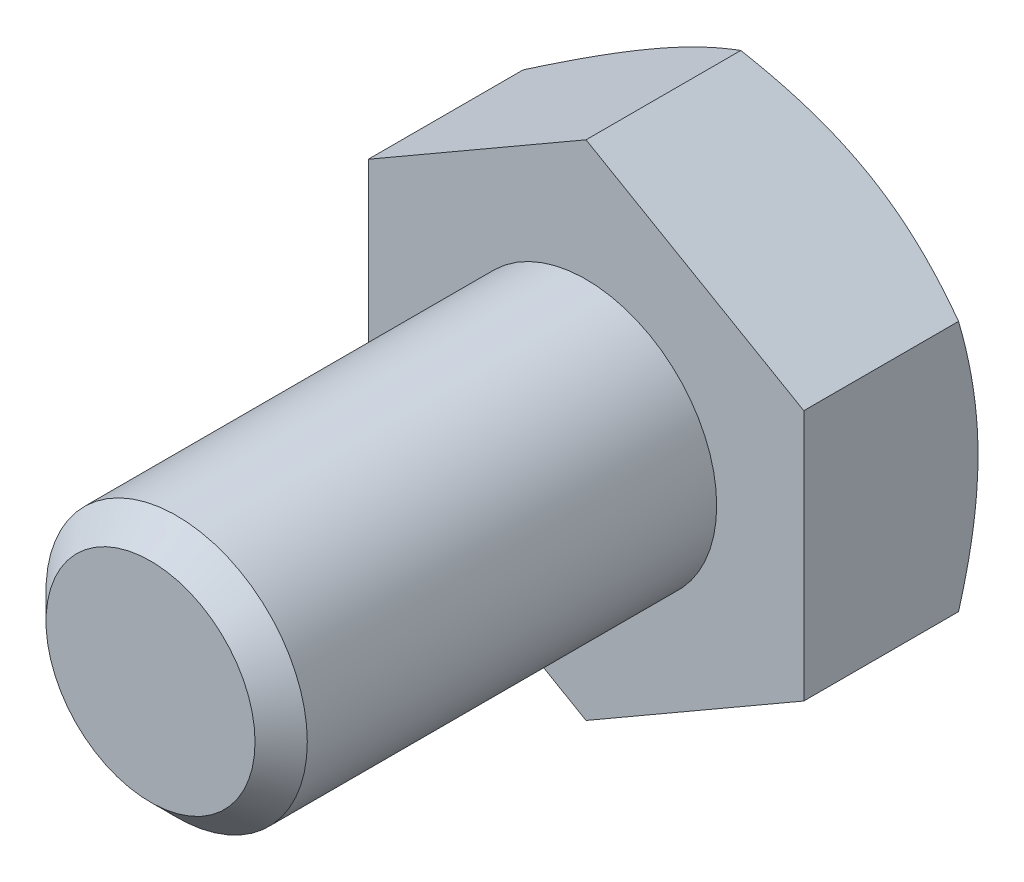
ISO-10303-21;
HEADER;
FILE_DESCRIPTION(('STEP AP214'),'2;1');
FILE_NAME('part.step','',(''),(''),'','','');
FILE_SCHEMA(('AUTOMOTIVE_DESIGN { 1 0 10303 214 1 1 1 1 }'));
ENDSEC;
DATA;
#1=APPLICATION_CONTEXT('core data for automotive mechanical design processes');
#2=APPLICATION_PROTOCOL_DEFINITION('international standard','automotive_design',2000,#1);
#3=PRODUCT_CONTEXT('',#1,'mechanical');
#4=PRODUCT('Part','Part','',(#3));
#5=PRODUCT_RELATED_PRODUCT_CATEGORY('part','',(#4));
#6=PRODUCT_DEFINITION_FORMATION('','',#4);
#7=PRODUCT_DEFINITION_CONTEXT('part definition',#1,'design');
#8=PRODUCT_DEFINITION('design','',#6,#7);
#9=PRODUCT_DEFINITION_SHAPE('','',#8);
#10=(LENGTH_UNIT() NAMED_UNIT(*) SI_UNIT(.MILLI.,.METRE.));
#11=(NAMED_UNIT(*) PLANE_ANGLE_UNIT() SI_UNIT($,.RADIAN.));
#12=(NAMED_UNIT(*) SI_UNIT($,.STERADIAN.) SOLID_ANGLE_UNIT());
#13=UNCERTAINTY_MEASURE_WITH_UNIT(LENGTH_MEASURE(1.E-05),#10,'distance_accuracy_value','');
#14=(GEOMETRIC_REPRESENTATION_CONTEXT(3) GLOBAL_UNCERTAINTY_ASSIGNED_CONTEXT((#13)) GLOBAL_UNIT_ASSIGNED_CONTEXT((#10,
#11,#12)) REPRESENTATION_CONTEXT('',''));
#15=CARTESIAN_POINT('',(0.,0.,0.));
#16=DIRECTION('',(0.,0.,1.));
#17=DIRECTION('',(1.,0.,0.));
#18=AXIS2_PLACEMENT_3D('',#15,#16,#17);
#19=CARTESIAN_POINT('',(0.,0.,10.));
#20=DIRECTION('',(0.,0.,1.));
#21=DIRECTION('',(1.,0.,0.));
#22=AXIS2_PLACEMENT_3D('',#19,#20,#21);
#23=PLANE('',#22);
#24=CARTESIAN_POINT('',(0.,0.,10.));
#25=DIRECTION('',(0.,0.,1.));
#26=DIRECTION('',(1.,0.,0.));
#27=AXIS2_PLACEMENT_3D('',#24,#25,#26);
#28=CIRCLE('',#27,2.4);
#29=CARTESIAN_POINT('',(2.4,0.,10.));
#30=VERTEX_POINT('',#29);
#31=EDGE_CURVE('E203',#30,#30,#28,.T.);
#32=ORIENTED_EDGE('',*,*,#31,.T.);
#33=EDGE_LOOP('',(#32));
#34=FACE_BOUND('',#33,.T.);
#35=ADVANCED_FACE('F29',(#34),#23,.T.);
#36=CARTESIAN_POINT('',(0.,0.,0.));
#37=DIRECTION('',(0.,0.,1.));
#38=DIRECTION('',(1.,0.,0.));
#39=AXIS2_PLACEMENT_3D('',#36,#37,#38);
#40=CYLINDRICAL_SURFACE('',#39,3.);
#41=CARTESIAN_POINT('',(0.,0.,9.4));
#42=DIRECTION('',(0.,0.,1.));
#43=DIRECTION('',(1.,0.,0.));
#44=AXIS2_PLACEMENT_3D('',#41,#42,#43);
#45=CIRCLE('',#44,3.);
#46=CARTESIAN_POINT('',(3.,0.,9.4));
#47=VERTEX_POINT('',#46);
#48=EDGE_CURVE('E205',#47,#47,#45,.F.);
#49=ORIENTED_EDGE('',*,*,#48,.T.);
#50=EDGE_LOOP('',(#49));
#51=FACE_BOUND('',#50,.T.);
#52=CARTESIAN_POINT('',(0.,0.,0.));
#53=DIRECTION('',(0.,0.,1.));
#54=DIRECTION('',(1.,0.,0.));
#55=AXIS2_PLACEMENT_3D('',#52,#53,#54);
#56=CIRCLE('',#55,3.);
#57=CARTESIAN_POINT('',(3.,0.,0.));
#58=VERTEX_POINT('',#57);
#59=EDGE_CURVE('E206',#58,#58,#56,.F.);
#60=ORIENTED_EDGE('',*,*,#59,.F.);
#61=EDGE_LOOP('',(#60));
#62=FACE_BOUND('',#61,.T.);
#63=ADVANCED_FACE('F194',(#51,#62),#40,.T.);
#64=CARTESIAN_POINT('',(0.,0.,10.));
#65=DIRECTION('',(0.,0.,-1.));
#66=DIRECTION('',(-1.,0.,0.));
#67=AXIS2_PLACEMENT_3D('',#64,#65,#66);
#68=CONICAL_SURFACE('',#67,2.4,0.785398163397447);
#69=ORIENTED_EDGE('',*,*,#48,.F.);
#70=EDGE_LOOP('',(#69));
#71=FACE_BOUND('',#70,.T.);
#72=ORIENTED_EDGE('',*,*,#31,.F.);
#73=EDGE_LOOP('',(#72));
#74=FACE_BOUND('',#73,.T.);
#75=ADVANCED_FACE('F199',(#71,#74),#68,.T.);
#76=CARTESIAN_POINT('',(0.,5.77350269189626,-4.));
#77=DIRECTION('',(0.499999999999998,0.86602540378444,0.));
#78=DIRECTION('',(-0.86602540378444,0.499999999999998,0.));
#79=AXIS2_PLACEMENT_3D('',#76,#77,#78);
#80=PLANE('',#79);
#81=CARTESIAN_POINT('',(-0.000200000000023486,5.7736181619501,-3.55335134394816));
#82=CARTESIAN_POINT('',(0.219534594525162,5.64675433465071,-3.62661343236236));
#83=CARTESIAN_POINT('',(0.441148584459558,5.5188054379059,-3.6932486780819));
#84=CARTESIAN_POINT('',(0.888213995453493,5.26069210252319,-3.80956100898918));
#85=CARTESIAN_POINT('',(1.11367335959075,5.13052307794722,-3.85919695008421));
#86=CARTESIAN_POINT('',(1.56183230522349,4.87177839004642,-3.9364489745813));
#87=CARTESIAN_POINT('',(1.78446209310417,4.74324302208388,-3.96457962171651));
#88=CARTESIAN_POINT('',(2.11918990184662,4.54998783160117,-3.98980507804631));
#89=CARTESIAN_POINT('',(2.23084219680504,4.48552534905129,-3.99538654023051));
#90=CARTESIAN_POINT('',(2.45424997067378,4.35654081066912,-4.00079778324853));
#91=CARTESIAN_POINT('',(2.5660054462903,4.29201875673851,-4.00062774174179));
#92=CARTESIAN_POINT('',(2.87218423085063,4.11524635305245,-3.99224636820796));
#93=CARTESIAN_POINT('',(3.0665060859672,4.00305457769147,-3.97817022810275));
#94=CARTESIAN_POINT('',(3.45386010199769,3.77941563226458,-3.93353474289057));
#95=CARTESIAN_POINT('',(3.64689090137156,3.66796924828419,-3.90296013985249));
#96=CARTESIAN_POINT('',(4.03502534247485,3.44387972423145,-3.82653150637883));
#97=CARTESIAN_POINT('',(4.23007999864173,3.33126486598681,-3.78035362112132));
#98=CARTESIAN_POINT('',(4.61728034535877,3.10771464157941,-3.67554820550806));
#99=CARTESIAN_POINT('',(4.80943099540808,2.99677641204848,-3.61694529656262));
#100=CARTESIAN_POINT('',(5.0002,2.8866358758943,-3.55335134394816));
#101=B_SPLINE_CURVE_WITH_KNOTS('',3,(#81,#82,#83,#84,#85,#86,#87,#88,#89,#90,#91,#92,#93,#94,
#95,#96,#97,#98,#99,#100),.UNSPECIFIED.,.F.,.F.,(4,2,2,2,2,2,2,2,2,4),(0.,0.792555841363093,
1.58701660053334,2.36181537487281,2.74884076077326,3.13585419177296,3.8096236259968,
4.4840172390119,5.1733688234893,5.86136694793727),.UNSPECIFIED.);
#102=CARTESIAN_POINT('',(0.,5.77350269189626,-3.55341801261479));
#103=VERTEX_POINT('',#102);
#104=CARTESIAN_POINT('',(2.49999999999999,4.3301270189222,-4.));
#105=VERTEX_POINT('',#104);
#106=EDGE_CURVE('E239',#103,#105,#101,.T.);
#107=ORIENTED_EDGE('',*,*,#106,.F.);
#108=DIRECTION('',(0.,0.,1.));
#109=VECTOR('',#108,1.);
#110=CARTESIAN_POINT('',(0.,5.77350269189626,-4.));
#111=LINE('',#110,#109);
#112=CARTESIAN_POINT('',(0.,5.77350269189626,0.));
#113=VERTEX_POINT('',#112);
#114=EDGE_CURVE('E213',#103,#113,#111,.T.);
#115=ORIENTED_EDGE('',*,*,#114,.T.);
#116=DIRECTION('',(-0.86602540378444,0.499999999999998,0.));
#117=VECTOR('',#116,1.);
#118=CARTESIAN_POINT('',(0.,5.77350269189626,0.));
#119=LINE('',#118,#117);
#120=CARTESIAN_POINT('',(5.,2.88675134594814,0.));
#121=VERTEX_POINT('',#120);
#122=EDGE_CURVE('E237',#121,#113,#119,.T.);
#123=ORIENTED_EDGE('',*,*,#122,.F.);
#124=DIRECTION('',(0.,0.,1.));
#125=VECTOR('',#124,1.);
#126=CARTESIAN_POINT('',(5.,2.88675134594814,-4.));
#127=LINE('',#126,#125);
#128=CARTESIAN_POINT('',(5.,2.88675134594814,-3.55341801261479));
#129=VERTEX_POINT('',#128);
#130=EDGE_CURVE('E210',#129,#121,#127,.T.);
#131=ORIENTED_EDGE('',*,*,#130,.F.);
#132=EDGE_CURVE('E169',#105,#129,#101,.T.);
#133=ORIENTED_EDGE('',*,*,#132,.F.);
#134=EDGE_LOOP('',(#107,#115,#123,#131,#133));
#135=FACE_BOUND('',#134,.T.);
#136=ADVANCED_FACE('F179',(#135),#80,.T.);
#137=CARTESIAN_POINT('',(5.,-2.88675134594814,-4.));
#138=DIRECTION('',(1.,0.,0.));
#139=DIRECTION('',(0.,0.,-1.));
#140=AXIS2_PLACEMENT_3D('',#137,#138,#139);
#141=PLANE('',#140);
#142=CARTESIAN_POINT('',(5.,-7.87365701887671,-1.5017575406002));
#143=CARTESIAN_POINT('',(5.,-7.65421637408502,-1.60868091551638));
#144=CARTESIAN_POINT('',(5.,-7.43428458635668,-1.71461296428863));
#145=CARTESIAN_POINT('',(5.,-6.99317792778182,-1.92393906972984));
#146=CARTESIAN_POINT('',(5.,-6.77200287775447,-2.02733274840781));
#147=CARTESIAN_POINT('',(5.,-6.32706593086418,-2.23152152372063));
#148=CARTESIAN_POINT('',(5.,-6.10329657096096,-2.3323004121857));
#149=CARTESIAN_POINT('',(5.,-5.65401907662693,-2.52988978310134));
#150=CARTESIAN_POINT('',(5.,-5.42851102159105,-2.62670044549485));
#151=CARTESIAN_POINT('',(5.,-4.96773019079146,-2.81850105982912));
#152=CARTESIAN_POINT('',(5.,-4.73238523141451,-2.91331851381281));
#153=CARTESIAN_POINT('',(5.,-4.2589865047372,-3.09606229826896));
#154=CARTESIAN_POINT('',(5.,-4.02093244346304,-3.18398787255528));
#155=CARTESIAN_POINT('',(5.,-3.54214478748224,-3.35072723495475));
#156=CARTESIAN_POINT('',(5.,-3.301417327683,-3.42955846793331));
#157=CARTESIAN_POINT('',(5.,-2.81651125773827,-3.57565910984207));
#158=CARTESIAN_POINT('',(5.,-2.57233372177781,-3.64293203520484));
#159=CARTESIAN_POINT('',(5.,-2.08173956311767,-3.7624103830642));
#160=CARTESIAN_POINT('',(5.,-1.83534384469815,-3.81470009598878));
#161=CARTESIAN_POINT('',(5.,-1.33936717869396,-3.90133365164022));
#162=CARTESIAN_POINT('',(5.,-1.08978658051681,-3.93567944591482));
#163=CARTESIAN_POINT('',(5.,-0.591994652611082,-3.98324171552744));
#164=CARTESIAN_POINT('',(5.,-0.34381084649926,-3.99673913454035));
#165=CARTESIAN_POINT('',(5.,0.152820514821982,-4.00220795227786));
#166=CARTESIAN_POINT('',(5.,0.401268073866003,-3.99417903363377));
#167=CARTESIAN_POINT('',(5.,0.819539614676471,-3.96311999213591));
#168=CARTESIAN_POINT('',(5.,0.989794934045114,-3.94552930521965));
#169=CARTESIAN_POINT('',(5.,1.32912938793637,-3.90127081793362));
#170=CARTESIAN_POINT('',(5.,1.49820837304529,-3.87460188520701));
#171=CARTESIAN_POINT('',(5.,2.00341173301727,-3.78237229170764));
#172=CARTESIAN_POINT('',(5.,2.33733597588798,-3.7046029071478));
#173=CARTESIAN_POINT('',(5.,2.83691487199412,-3.56883106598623));
#174=CARTESIAN_POINT('',(5.,3.00513229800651,-3.51971360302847));
#175=CARTESIAN_POINT('',(5.,3.33993504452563,-3.41615110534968));
#176=CARTESIAN_POINT('',(5.,3.50652035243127,-3.36170602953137));
#177=CARTESIAN_POINT('',(5.,3.83810926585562,-3.24838071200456));
#178=CARTESIAN_POINT('',(5.,4.00311330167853,-3.18950171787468));
#179=CARTESIAN_POINT('',(5.,4.33173746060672,-3.06802383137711));
#180=CARTESIAN_POINT('',(5.,4.49535761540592,-3.00542502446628));
#181=CARTESIAN_POINT('',(5.,4.9359829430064,-2.83201950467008));
#182=CARTESIAN_POINT('',(5.,5.21182602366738,-2.71826266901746));
#183=CARTESIAN_POINT('',(5.,5.76066658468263,-2.48405585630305));
#184=CARTESIAN_POINT('',(5.,6.03366374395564,-2.36360513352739));
#185=CARTESIAN_POINT('',(5.,6.57746623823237,-2.11759609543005));
#186=CARTESIAN_POINT('',(5.,6.84827068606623,-1.99203582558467));
#187=CARTESIAN_POINT('',(5.,7.38802449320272,-1.73703058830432));
#188=CARTESIAN_POINT('',(5.,7.65697392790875,-1.60758577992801));
#189=CARTESIAN_POINT('',(5.,8.19381940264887,-1.34544789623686));
#190=CARTESIAN_POINT('',(5.,8.46171304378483,-1.21274991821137));
#191=CARTESIAN_POINT('',(5.,8.99628800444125,-0.944933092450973));
#192=CARTESIAN_POINT('',(5.,9.26296931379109,-0.809814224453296));
#193=CARTESIAN_POINT('',(5.,10.0614145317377,-0.401627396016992));
#194=CARTESIAN_POINT('',(5.,10.5917004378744,-0.125669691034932));
#195=CARTESIAN_POINT('',(5.,11.5934978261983,0.401869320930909));
#196=CARTESIAN_POINT('',(5.,12.0652823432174,0.652934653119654));
#197=CARTESIAN_POINT('',(5.,13.0072652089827,1.1580917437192));
#198=CARTESIAN_POINT('',(5.,13.4774634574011,1.41218368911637));
#199=CARTESIAN_POINT('',(5.,14.4150598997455,1.92174727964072));
#200=CARTESIAN_POINT('',(5.,14.8824621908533,2.17721139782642));
#201=CARTESIAN_POINT('',(5.,15.8162766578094,2.68985606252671));
#202=CARTESIAN_POINT('',(5.,16.2826889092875,2.94703647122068));
#203=CARTESIAN_POINT('',(5.,16.7487534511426,3.20484156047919));
#204=B_SPLINE_CURVE_WITH_KNOTS('',3,(#142,#143,#144,#145,#146,#147,#148,#149,#150,#151,#152,
#153,#154,#155,#156,#157,#158,#159,#160,#161,#162,#163,#164,#165,#166,#167,#168,#169,#170,#171,
#172,#173,#174,#175,#176,#177,#178,#179,#180,#181,#182,#183,#184,#185,#186,#187,#188,#189,#190,
#191,#192,#193,#194,#195,#196,#197,#198,#199,#200,#201,#202,#203),.UNSPECIFIED.,.F.,.F.,(4,2,2,
2,2,2,2,2,2,2,2,2,2,2,2,2,2,2,2,2,2,2,2,2,2,2,2,2,2,2,4),(0.,0.732320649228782,1.46474969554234,
2.20096737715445,2.93715163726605,3.69825037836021,4.45943251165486,5.2191293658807,
5.97859468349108,6.73369963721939,7.48872245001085,8.2334792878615,8.97824710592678,
9.49148539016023,10.0047877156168,11.0318914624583,11.5575684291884,12.0832494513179,
12.6087831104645,13.1343047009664,14.0293094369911,14.9244140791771,15.819864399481,
16.7152781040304,17.612136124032,18.5090016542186,20.3023290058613,21.9056050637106,
23.5089806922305,25.106957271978,26.7048070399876),.UNSPECIFIED.);
#205=CARTESIAN_POINT('',(5.,0.,-4.));
#206=VERTEX_POINT('',#205);
#207=EDGE_CURVE('E167',#129,#206,#204,.F.);
#208=ORIENTED_EDGE('',*,*,#207,.F.);
#209=ORIENTED_EDGE('',*,*,#130,.T.);
#210=DIRECTION('',(0.,1.,0.));
#211=VECTOR('',#210,1.);
#212=CARTESIAN_POINT('',(5.,-2.88675134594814,0.));
#213=LINE('',#212,#211);
#214=CARTESIAN_POINT('',(5.,-2.88675134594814,0.));
#215=VERTEX_POINT('',#214);
#216=EDGE_CURVE('E215',#215,#121,#213,.T.);
#217=ORIENTED_EDGE('',*,*,#216,.F.);
#218=DIRECTION('',(0.,0.,1.));
#219=VECTOR('',#218,1.);
#220=CARTESIAN_POINT('',(5.,-2.88675134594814,-4.));
#221=LINE('',#220,#219);
#222=CARTESIAN_POINT('',(5.,-2.88675134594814,-3.55341801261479));
#223=VERTEX_POINT('',#222);
#224=EDGE_CURVE('E221',#223,#215,#221,.T.);
#225=ORIENTED_EDGE('',*,*,#224,.F.);
#226=EDGE_CURVE('E162',#206,#223,#204,.F.);
#227=ORIENTED_EDGE('',*,*,#226,.F.);
#228=EDGE_LOOP('',(#208,#209,#217,#225,#227));
#229=FACE_BOUND('',#228,.T.);
#230=ADVANCED_FACE('F175',(#229),#141,.T.);
#231=CARTESIAN_POINT('',(0.,-5.77350269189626,-4.));
#232=DIRECTION('',(0.499999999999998,-0.86602540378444,0.));
#233=DIRECTION('',(0.86602540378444,0.499999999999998,0.));
#234=AXIS2_PLACEMENT_3D('',#231,#232,#233);
#235=PLANE('',#234);
#236=CARTESIAN_POINT('',(5.0002,-2.8866358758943,-3.55335134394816));
#237=CARTESIAN_POINT('',(4.78046540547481,-3.01349970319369,-3.62661343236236));
#238=CARTESIAN_POINT('',(4.55885141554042,-3.1414485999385,-3.6932486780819));
#239=CARTESIAN_POINT('',(4.11178600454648,-3.39956193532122,-3.80956100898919));
#240=CARTESIAN_POINT('',(3.88632664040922,-3.52973095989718,-3.85919695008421));
#241=CARTESIAN_POINT('',(3.43816769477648,-3.78847564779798,-3.9364489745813));
#242=CARTESIAN_POINT('',(3.2155379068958,-3.91701101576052,-3.96457962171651));
#243=CARTESIAN_POINT('',(2.88081009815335,-4.11026620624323,-3.98980507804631));
#244=CARTESIAN_POINT('',(2.76915780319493,-4.17472868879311,-3.99538654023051));
#245=CARTESIAN_POINT('',(2.54575002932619,-4.30371322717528,-4.00079778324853));
#246=CARTESIAN_POINT('',(2.43399455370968,-4.36823528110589,-4.00062774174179));
#247=CARTESIAN_POINT('',(2.12781576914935,-4.54500768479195,-3.99224636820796));
#248=CARTESIAN_POINT('',(1.93349391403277,-4.65719946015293,-3.97817022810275));
#249=CARTESIAN_POINT('',(1.54613989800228,-4.88083840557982,-3.93353474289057));
#250=CARTESIAN_POINT('',(1.35310909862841,-4.99228478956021,-3.90296013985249));
#251=CARTESIAN_POINT('',(0.964974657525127,-5.21637431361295,-3.82653150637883));
#252=CARTESIAN_POINT('',(0.769920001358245,-5.32898917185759,-3.78035362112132));
#253=CARTESIAN_POINT('',(0.38271965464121,-5.55253939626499,-3.67554820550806));
#254=CARTESIAN_POINT('',(0.190569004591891,-5.66347762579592,-3.61694529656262));
#255=CARTESIAN_POINT('',(-0.000200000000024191,-5.7736181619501,-3.55335134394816));
#256=B_SPLINE_CURVE_WITH_KNOTS('',3,(#236,#237,#238,#239,#240,#241,#242,#243,#244,#245,#246,
#247,#248,#249,#250,#251,#252,#253,#254,#255),.UNSPECIFIED.,.F.,.F.,(4,2,2,2,2,2,2,2,2,4),(0.,
0.792555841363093,1.58701660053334,2.36181537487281,2.74884076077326,3.13585419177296,
3.8096236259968,4.48401723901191,5.1733688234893,5.86136694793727),.UNSPECIFIED.);
#257=CARTESIAN_POINT('',(2.49999999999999,-4.3301270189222,-4.));
#258=VERTEX_POINT('',#257);
#259=EDGE_CURVE('E168',#223,#258,#256,.T.);
#260=ORIENTED_EDGE('',*,*,#259,.F.);
#261=ORIENTED_EDGE('',*,*,#224,.T.);
#262=DIRECTION('',(0.86602540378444,0.499999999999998,0.));
#263=VECTOR('',#262,1.);
#264=CARTESIAN_POINT('',(0.,-5.77350269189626,0.));
#265=LINE('',#264,#263);
#266=CARTESIAN_POINT('',(0.,-5.77350269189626,0.));
#267=VERTEX_POINT('',#266);
#268=EDGE_CURVE('E226',#267,#215,#265,.T.);
#269=ORIENTED_EDGE('',*,*,#268,.F.);
#270=DIRECTION('',(0.,0.,1.));
#271=VECTOR('',#270,1.);
#272=CARTESIAN_POINT('',(0.,-5.77350269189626,-4.));
#273=LINE('',#272,#271);
#274=CARTESIAN_POINT('',(0.,-5.77350269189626,-3.55341801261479));
#275=VERTEX_POINT('',#274);
#276=EDGE_CURVE('E219',#275,#267,#273,.T.);
#277=ORIENTED_EDGE('',*,*,#276,.F.);
#278=EDGE_CURVE('E156',#258,#275,#256,.T.);
#279=ORIENTED_EDGE('',*,*,#278,.F.);
#280=EDGE_LOOP('',(#260,#261,#269,#277,#279));
#281=FACE_BOUND('',#280,.T.);
#282=ADVANCED_FACE('F178',(#281),#235,.T.);
#283=CARTESIAN_POINT('',(0.,-5.77350269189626,-4.));
#284=DIRECTION('',(-0.500000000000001,-0.866025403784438,0.));
#285=DIRECTION('',(0.866025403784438,-0.500000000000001,0.));
#286=AXIS2_PLACEMENT_3D('',#283,#284,#285);
#287=PLANE('',#286);
#288=CARTESIAN_POINT('',(0.000199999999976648,-5.7736181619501,-3.55335134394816));
#289=CARTESIAN_POINT('',(-0.219534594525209,-5.64675433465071,-3.62661343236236));
#290=CARTESIAN_POINT('',(-0.441148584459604,-5.5188054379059,-3.6932486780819));
#291=CARTESIAN_POINT('',(-0.888213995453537,-5.26069210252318,-3.80956100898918));
#292=CARTESIAN_POINT('',(-1.1136733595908,-5.13052307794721,-3.8591969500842));
#293=CARTESIAN_POINT('',(-1.56183230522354,-4.87177839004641,-3.9364489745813));
#294=CARTESIAN_POINT('',(-1.78446209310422,-4.74324302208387,-3.9645796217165));
#295=CARTESIAN_POINT('',(-2.11918990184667,-4.54998783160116,-3.98980507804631));
#296=CARTESIAN_POINT('',(-2.23084219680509,-4.48552534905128,-3.99538654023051));
#297=CARTESIAN_POINT('',(-2.45424997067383,-4.35654081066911,-4.00079778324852));
#298=CARTESIAN_POINT('',(-2.56600544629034,-4.2920187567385,-4.00062774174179));
#299=CARTESIAN_POINT('',(-2.87218423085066,-4.11524635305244,-3.99224636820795));
#300=CARTESIAN_POINT('',(-3.06650608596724,-4.00305457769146,-3.97817022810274));
#301=CARTESIAN_POINT('',(-3.45386010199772,-3.77941563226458,-3.93353474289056));
#302=CARTESIAN_POINT('',(-3.64689090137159,-3.66796924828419,-3.90296013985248));
#303=CARTESIAN_POINT('',(-4.03502534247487,-3.44387972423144,-3.82653150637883));
#304=CARTESIAN_POINT('',(-4.23007999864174,-3.33126486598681,-3.78035362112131));
#305=CARTESIAN_POINT('',(-4.61728034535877,-3.10771464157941,-3.67554820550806));
#306=CARTESIAN_POINT('',(-4.80943099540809,-2.99677641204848,-3.61694529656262));
#307=CARTESIAN_POINT('',(-5.0002,-2.8866358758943,-3.55335134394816));
#308=B_SPLINE_CURVE_WITH_KNOTS('',3,(#288,#289,#290,#291,#292,#293,#294,#295,#296,#297,#298,
#299,#300,#301,#302,#303,#304,#305,#306,#307),.UNSPECIFIED.,.F.,.F.,(4,2,2,2,2,2,2,2,2,4),(0.,
0.792555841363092,1.58701660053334,2.36181537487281,2.74884076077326,3.13585419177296,
3.80962362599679,4.48401723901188,5.17336882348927,5.86136694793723),.UNSPECIFIED.);
#309=CARTESIAN_POINT('',(-2.50000000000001,-4.33012701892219,-4.));
#310=VERTEX_POINT('',#309);
#311=EDGE_CURVE('E258',#275,#310,#308,.T.);
#312=ORIENTED_EDGE('',*,*,#311,.F.);
#313=ORIENTED_EDGE('',*,*,#276,.T.);
#314=DIRECTION('',(0.866025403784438,-0.500000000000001,0.));
#315=VECTOR('',#314,1.);
#316=CARTESIAN_POINT('',(0.,-5.77350269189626,0.));
#317=LINE('',#316,#315);
#318=CARTESIAN_POINT('',(-5.,-2.88675134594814,0.));
#319=VERTEX_POINT('',#318);
#320=EDGE_CURVE('E229',#319,#267,#317,.T.);
#321=ORIENTED_EDGE('',*,*,#320,.F.);
#322=DIRECTION('',(0.,0.,1.));
#323=VECTOR('',#322,1.);
#324=CARTESIAN_POINT('',(-5.,-2.88675134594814,-4.));
#325=LINE('',#324,#323);
#326=CARTESIAN_POINT('',(-5.,-2.88675134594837,-3.55341801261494));
#327=VERTEX_POINT('',#326);
#328=EDGE_CURVE('E217',#327,#319,#325,.T.);
#329=ORIENTED_EDGE('',*,*,#328,.F.);
#330=EDGE_CURVE('E105',#310,#327,#308,.T.);
#331=ORIENTED_EDGE('',*,*,#330,.F.);
#332=EDGE_LOOP('',(#312,#313,#321,#329,#331));
#333=FACE_BOUND('',#332,.T.);
#334=ADVANCED_FACE('F183',(#333),#287,.T.);
#335=CARTESIAN_POINT('',(-5.,-2.88675134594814,-4.));
#336=DIRECTION('',(-1.,0.,0.));
#337=DIRECTION('',(0.,0.,1.));
#338=AXIS2_PLACEMENT_3D('',#335,#336,#337);
#339=PLANE('',#338);
#340=CARTESIAN_POINT('',(-5.,-7.8736570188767,-1.5017575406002));
#341=CARTESIAN_POINT('',(-5.,-7.65421637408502,-1.60868091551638));
#342=CARTESIAN_POINT('',(-5.,-7.43428458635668,-1.71461296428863));
#343=CARTESIAN_POINT('',(-5.,-6.99317792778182,-1.92393906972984));
#344=CARTESIAN_POINT('',(-5.,-6.77200287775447,-2.02733274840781));
#345=CARTESIAN_POINT('',(-5.,-6.32706593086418,-2.23152152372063));
#346=CARTESIAN_POINT('',(-5.,-6.10329657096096,-2.3323004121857));
#347=CARTESIAN_POINT('',(-5.,-5.65401907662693,-2.52988978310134));
#348=CARTESIAN_POINT('',(-5.,-5.42851102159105,-2.62670044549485));
#349=CARTESIAN_POINT('',(-5.,-4.96773019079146,-2.81850105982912));
#350=CARTESIAN_POINT('',(-5.,-4.73238523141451,-2.91331851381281));
#351=CARTESIAN_POINT('',(-5.,-4.2589865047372,-3.09606229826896));
#352=CARTESIAN_POINT('',(-5.,-4.02093244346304,-3.18398787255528));
#353=CARTESIAN_POINT('',(-5.,-3.54214478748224,-3.35072723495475));
#354=CARTESIAN_POINT('',(-5.,-3.301417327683,-3.42955846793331));
#355=CARTESIAN_POINT('',(-5.,-2.81651125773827,-3.57565910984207));
#356=CARTESIAN_POINT('',(-5.,-2.57233372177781,-3.64293203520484));
#357=CARTESIAN_POINT('',(-5.,-2.08173956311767,-3.7624103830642));
#358=CARTESIAN_POINT('',(-5.,-1.83534384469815,-3.81470009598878));
#359=CARTESIAN_POINT('',(-5.,-1.33936717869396,-3.90133365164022));
#360=CARTESIAN_POINT('',(-5.,-1.08978658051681,-3.93567944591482));
#361=CARTESIAN_POINT('',(-5.,-0.591994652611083,-3.98324171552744));
#362=CARTESIAN_POINT('',(-5.,-0.343810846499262,-3.99673913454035));
#363=CARTESIAN_POINT('',(-5.,0.152820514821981,-4.00220795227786));
#364=CARTESIAN_POINT('',(-5.,0.401268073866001,-3.99417903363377));
#365=CARTESIAN_POINT('',(-5.,0.81953961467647,-3.96311999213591));
#366=CARTESIAN_POINT('',(-5.,0.989794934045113,-3.94552930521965));
#367=CARTESIAN_POINT('',(-5.,1.32912938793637,-3.90127081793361));
#368=CARTESIAN_POINT('',(-5.,1.49820837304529,-3.87460188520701));
#369=CARTESIAN_POINT('',(-5.,2.00341173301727,-3.78237229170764));
#370=CARTESIAN_POINT('',(-5.,2.33733597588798,-3.7046029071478));
#371=CARTESIAN_POINT('',(-5.,2.83691487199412,-3.56883106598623));
#372=CARTESIAN_POINT('',(-5.,3.00513229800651,-3.51971360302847));
#373=CARTESIAN_POINT('',(-5.,3.33993504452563,-3.41615110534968));
#374=CARTESIAN_POINT('',(-5.,3.50652035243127,-3.36170602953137));
#375=CARTESIAN_POINT('',(-5.,3.83810926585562,-3.24838071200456));
#376=CARTESIAN_POINT('',(-5.,4.00311330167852,-3.18950171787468));
#377=CARTESIAN_POINT('',(-5.,4.33173746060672,-3.06802383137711));
#378=CARTESIAN_POINT('',(-5.,4.49535761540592,-3.00542502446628));
#379=CARTESIAN_POINT('',(-5.,4.9359829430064,-2.83201950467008));
#380=CARTESIAN_POINT('',(-5.,5.21182602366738,-2.71826266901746));
#381=CARTESIAN_POINT('',(-5.,5.76066658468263,-2.48405585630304));
#382=CARTESIAN_POINT('',(-5.,6.03366374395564,-2.36360513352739));
#383=CARTESIAN_POINT('',(-5.,6.57746623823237,-2.11759609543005));
#384=CARTESIAN_POINT('',(-5.,6.84827068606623,-1.99203582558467));
#385=CARTESIAN_POINT('',(-5.,7.38802449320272,-1.73703058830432));
#386=CARTESIAN_POINT('',(-5.,7.65697392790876,-1.60758577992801));
#387=CARTESIAN_POINT('',(-5.,8.19381940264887,-1.34544789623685));
#388=CARTESIAN_POINT('',(-5.,8.46171304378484,-1.21274991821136));
#389=CARTESIAN_POINT('',(-5.,8.99628800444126,-0.944933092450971));
#390=CARTESIAN_POINT('',(-5.,9.26296931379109,-0.809814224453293));
#391=CARTESIAN_POINT('',(-5.,10.0614145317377,-0.401627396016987));
#392=CARTESIAN_POINT('',(-5.,10.5917004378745,-0.125669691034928));
#393=CARTESIAN_POINT('',(-5.,11.5934978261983,0.401869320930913));
#394=CARTESIAN_POINT('',(-5.,12.0652823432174,0.652934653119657));
#395=CARTESIAN_POINT('',(-5.,13.0072652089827,1.15809174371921));
#396=CARTESIAN_POINT('',(-5.,13.4774634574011,1.41218368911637));
#397=CARTESIAN_POINT('',(-5.,14.4150598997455,1.92174727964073));
#398=CARTESIAN_POINT('',(-5.,14.8824621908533,2.17721139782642));
#399=CARTESIAN_POINT('',(-5.,15.8162766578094,2.68985606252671));
#400=CARTESIAN_POINT('',(-5.,16.2826889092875,2.94703647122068));
#401=CARTESIAN_POINT('',(-5.,16.7487534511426,3.20484156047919));
#402=B_SPLINE_CURVE_WITH_KNOTS('',3,(#340,#341,#342,#343,#344,#345,#346,#347,#348,#349,#350,
#351,#352,#353,#354,#355,#356,#357,#358,#359,#360,#361,#362,#363,#364,#365,#366,#367,#368,#369,
#370,#371,#372,#373,#374,#375,#376,#377,#378,#379,#380,#381,#382,#383,#384,#385,#386,#387,#388,
#389,#390,#391,#392,#393,#394,#395,#396,#397,#398,#399,#400,#401),.UNSPECIFIED.,.F.,.F.,(4,2,2,
2,2,2,2,2,2,2,2,2,2,2,2,2,2,2,2,2,2,2,2,2,2,2,2,2,2,2,4),(0.,0.732320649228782,1.46474969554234,
2.20096737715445,2.93715163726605,3.69825037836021,4.45943251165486,5.2191293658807,
5.97859468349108,6.73369963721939,7.48872245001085,8.2334792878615,8.97824710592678,
9.49148539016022,10.0047877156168,11.0318914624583,11.5575684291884,12.0832494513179,
12.6087831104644,13.1343047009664,14.0293094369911,14.9244140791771,15.819864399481,
16.7152781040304,17.612136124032,18.5090016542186,20.3023290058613,21.9056050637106,
23.5089806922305,25.106957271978,26.7048070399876),.UNSPECIFIED.);
#403=CARTESIAN_POINT('',(-5.,0.,-4.));
#404=VERTEX_POINT('',#403);
#405=EDGE_CURVE('E100',#327,#404,#402,.T.);
#406=ORIENTED_EDGE('',*,*,#405,.F.);
#407=ORIENTED_EDGE('',*,*,#328,.T.);
#408=DIRECTION('',(0.,-1.,0.));
#409=VECTOR('',#408,1.);
#410=CARTESIAN_POINT('',(-5.,-2.88675134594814,0.));
#411=LINE('',#410,#409);
#412=CARTESIAN_POINT('',(-5.,2.88675134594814,0.));
#413=VERTEX_POINT('',#412);
#414=EDGE_CURVE('E232',#413,#319,#411,.T.);
#415=ORIENTED_EDGE('',*,*,#414,.F.);
#416=DIRECTION('',(0.,0.,1.));
#417=VECTOR('',#416,1.);
#418=CARTESIAN_POINT('',(-5.,2.88675134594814,-4.));
#419=LINE('',#418,#417);
#420=CARTESIAN_POINT('',(-5.,2.88675134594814,-3.55341801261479));
#421=VERTEX_POINT('',#420);
#422=EDGE_CURVE('E126',#421,#413,#419,.T.);
#423=ORIENTED_EDGE('',*,*,#422,.F.);
#424=EDGE_CURVE('E109',#404,#421,#402,.T.);
#425=ORIENTED_EDGE('',*,*,#424,.F.);
#426=EDGE_LOOP('',(#406,#407,#415,#423,#425));
#427=FACE_BOUND('',#426,.T.);
#428=ADVANCED_FACE('F124',(#427),#339,.T.);
#429=CARTESIAN_POINT('',(-5.,2.88675134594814,-4.));
#430=DIRECTION('',(-0.500000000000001,0.866025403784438,0.));
#431=DIRECTION('',(-0.866025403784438,-0.500000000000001,0.));
#432=AXIS2_PLACEMENT_3D('',#429,#430,#431);
#433=PLANE('',#432);
#434=CARTESIAN_POINT('',(-5.0002,2.8866358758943,-3.55335134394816));
#435=CARTESIAN_POINT('',(-4.78046540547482,3.01349970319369,-3.62661343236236));
#436=CARTESIAN_POINT('',(-4.55885141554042,3.1414485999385,-3.6932486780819));
#437=CARTESIAN_POINT('',(-4.11178600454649,3.39956193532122,-3.80956100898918));
#438=CARTESIAN_POINT('',(-3.88632664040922,3.52973095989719,-3.8591969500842));
#439=CARTESIAN_POINT('',(-3.43816769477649,3.78847564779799,-3.9364489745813));
#440=CARTESIAN_POINT('',(-3.2155379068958,3.91701101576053,-3.9645796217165));
#441=CARTESIAN_POINT('',(-2.88081009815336,4.11026620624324,-3.98980507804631));
#442=CARTESIAN_POINT('',(-2.76915780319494,4.17472868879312,-3.99538654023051));
#443=CARTESIAN_POINT('',(-2.5457500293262,4.30371322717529,-4.00079778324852));
#444=CARTESIAN_POINT('',(-2.43399455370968,4.3682352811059,-4.00062774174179));
#445=CARTESIAN_POINT('',(-2.12781576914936,4.54500768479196,-3.99224636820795));
#446=CARTESIAN_POINT('',(-1.93349391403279,4.65719946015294,-3.97817022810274));
#447=CARTESIAN_POINT('',(-1.5461398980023,4.88083840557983,-3.93353474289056));
#448=CARTESIAN_POINT('',(-1.35310909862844,4.99228478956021,-3.90296013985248));
#449=CARTESIAN_POINT('',(-0.964974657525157,5.21637431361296,-3.82653150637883));
#450=CARTESIAN_POINT('',(-0.769920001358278,5.32898917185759,-3.78035362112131));
#451=CARTESIAN_POINT('',(-0.38271965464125,5.55253939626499,-3.67554820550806));
#452=CARTESIAN_POINT('',(-0.190569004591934,5.66347762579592,-3.61694529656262));
#453=CARTESIAN_POINT('',(0.000199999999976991,5.7736181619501,-3.55335134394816));
#454=B_SPLINE_CURVE_WITH_KNOTS('',3,(#434,#435,#436,#437,#438,#439,#440,#441,#442,#443,#444,
#445,#446,#447,#448,#449,#450,#451,#452,#453),.UNSPECIFIED.,.F.,.F.,(4,2,2,2,2,2,2,2,2,4),(0.,
0.792555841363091,1.58701660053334,2.36181537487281,2.74884076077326,3.13585419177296,
3.80962362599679,4.48401723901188,5.17336882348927,5.86136694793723),.UNSPECIFIED.);
#455=CARTESIAN_POINT('',(-2.50000000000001,4.3301270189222,-4.));
#456=VERTEX_POINT('',#455);
#457=EDGE_CURVE('E115',#421,#456,#454,.T.);
#458=ORIENTED_EDGE('',*,*,#457,.F.);
#459=ORIENTED_EDGE('',*,*,#422,.T.);
#460=DIRECTION('',(-0.866025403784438,-0.500000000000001,0.));
#461=VECTOR('',#460,1.);
#462=CARTESIAN_POINT('',(-5.,2.88675134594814,0.));
#463=LINE('',#462,#461);
#464=EDGE_CURVE('E235',#113,#413,#463,.T.);
#465=ORIENTED_EDGE('',*,*,#464,.F.);
#466=ORIENTED_EDGE('',*,*,#114,.F.);
#467=EDGE_CURVE('E117',#456,#103,#454,.T.);
#468=ORIENTED_EDGE('',*,*,#467,.F.);
#469=EDGE_LOOP('',(#458,#459,#465,#466,#468));
#470=FACE_BOUND('',#469,.T.);
#471=ADVANCED_FACE('F191',(#470),#433,.T.);
#472=CARTESIAN_POINT('',(5.,2.88675134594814,0.));
#473=DIRECTION('',(0.,0.,1.));
#474=DIRECTION('',(1.,0.,0.));
#475=AXIS2_PLACEMENT_3D('',#472,#473,#474);
#476=PLANE('',#475);
#477=ORIENTED_EDGE('',*,*,#59,.T.);
#478=EDGE_LOOP('',(#477));
#479=FACE_BOUND('',#478,.T.);
#480=ORIENTED_EDGE('',*,*,#122,.T.);
#481=ORIENTED_EDGE('',*,*,#464,.T.);
#482=ORIENTED_EDGE('',*,*,#414,.T.);
#483=ORIENTED_EDGE('',*,*,#320,.T.);
#484=ORIENTED_EDGE('',*,*,#268,.T.);
#485=ORIENTED_EDGE('',*,*,#216,.T.);
#486=EDGE_LOOP('',(#480,#481,#482,#483,#484,#485));
#487=FACE_BOUND('',#486,.T.);
#488=ADVANCED_FACE('F148',(#479,#487),#476,.T.);
#489=CARTESIAN_POINT('',(0.,0.,0.));
#490=DIRECTION('',(0.,0.,1.));
#491=DIRECTION('',(1.,0.,0.));
#492=AXIS2_PLACEMENT_3D('',#489,#490,#491);
#493=CONICAL_SURFACE('',#492,11.9282032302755,1.0471975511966);
#494=ORIENTED_EDGE('',*,*,#132,.T.);
#495=ORIENTED_EDGE('',*,*,#207,.T.);
#496=CARTESIAN_POINT('',(0.,0.,-4.));
#497=DIRECTION('',(0.,0.,1.));
#498=DIRECTION('',(1.,0.,0.));
#499=AXIS2_PLACEMENT_3D('',#496,#497,#498);
#500=CIRCLE('',#499,5.);
#501=EDGE_CURVE('E32',#105,#206,#500,.F.);
#502=ORIENTED_EDGE('',*,*,#501,.F.);
#503=EDGE_LOOP('',(#494,#495,#502));
#504=FACE_BOUND('',#503,.T.);
#505=ADVANCED_FACE('F248',(#504),#493,.T.);
#506=ORIENTED_EDGE('',*,*,#106,.T.);
#507=EDGE_CURVE('E122',#456,#105,#500,.F.);
#508=ORIENTED_EDGE('',*,*,#507,.F.);
#509=ORIENTED_EDGE('',*,*,#467,.T.);
#510=EDGE_LOOP('',(#506,#508,#509));
#511=FACE_BOUND('',#510,.T.);
#512=ADVANCED_FACE('F147',(#511),#493,.T.);
#513=ORIENTED_EDGE('',*,*,#424,.T.);
#514=ORIENTED_EDGE('',*,*,#457,.T.);
#515=CARTESIAN_POINT('',(0.,0.,-4.));
#516=DIRECTION('',(0.,0.,-1.));
#517=DIRECTION('',(-1.,0.,0.));
#518=AXIS2_PLACEMENT_3D('',#515,#516,#517);
#519=CIRCLE('',#518,5.);
#520=EDGE_CURVE('E50',#404,#456,#519,.T.);
#521=ORIENTED_EDGE('',*,*,#520,.F.);
#522=EDGE_LOOP('',(#513,#514,#521));
#523=FACE_BOUND('',#522,.T.);
#524=ADVANCED_FACE('F113',(#523),#493,.T.);
#525=ORIENTED_EDGE('',*,*,#330,.T.);
#526=ORIENTED_EDGE('',*,*,#405,.T.);
#527=EDGE_CURVE('E102',#310,#404,#500,.F.);
#528=ORIENTED_EDGE('',*,*,#527,.F.);
#529=EDGE_LOOP('',(#525,#526,#528));
#530=FACE_BOUND('',#529,.T.);
#531=ADVANCED_FACE('F101',(#530),#493,.T.);
#532=ORIENTED_EDGE('',*,*,#278,.T.);
#533=ORIENTED_EDGE('',*,*,#311,.T.);
#534=EDGE_CURVE('E37',#258,#310,#500,.F.);
#535=ORIENTED_EDGE('',*,*,#534,.F.);
#536=EDGE_LOOP('',(#532,#533,#535));
#537=FACE_BOUND('',#536,.T.);
#538=ADVANCED_FACE('F260',(#537),#493,.T.);
#539=ORIENTED_EDGE('',*,*,#226,.T.);
#540=ORIENTED_EDGE('',*,*,#259,.T.);
#541=EDGE_CURVE('E11',#206,#258,#500,.F.);
#542=ORIENTED_EDGE('',*,*,#541,.F.);
#543=EDGE_LOOP('',(#539,#540,#542));
#544=FACE_BOUND('',#543,.T.);
#545=ADVANCED_FACE('F255',(#544),#493,.T.);
#546=CARTESIAN_POINT('',(5.,2.88675134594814,-4.));
#547=DIRECTION('',(0.,0.,1.));
#548=DIRECTION('',(1.,0.,0.));
#549=AXIS2_PLACEMENT_3D('',#546,#547,#548);
#550=PLANE('',#549);
#551=ORIENTED_EDGE('',*,*,#501,.T.);
#552=ORIENTED_EDGE('',*,*,#541,.T.);
#553=ORIENTED_EDGE('',*,*,#534,.T.);
#554=ORIENTED_EDGE('',*,*,#527,.T.);
#555=ORIENTED_EDGE('',*,*,#520,.T.);
#556=ORIENTED_EDGE('',*,*,#507,.T.);
#557=EDGE_LOOP('',(#551,#552,#553,#554,#555,#556));
#558=FACE_BOUND('',#557,.T.);
#559=ADVANCED_FACE('F120',(#558),#550,.F.);
#560=CLOSED_SHELL('',(#35,#63,#75,#136,#230,#282,#334,#428,#471,#488,#505,#512,#524,#531,#538,
#545,#559));
#561=MANIFOLD_SOLID_BREP('B2',#560);
#562=ADVANCED_BREP_SHAPE_REPRESENTATION('',(#18,#561),#14);
#563=SHAPE_DEFINITION_REPRESENTATION(#9,#562);
ENDSEC;
END-ISO-10303-21;
